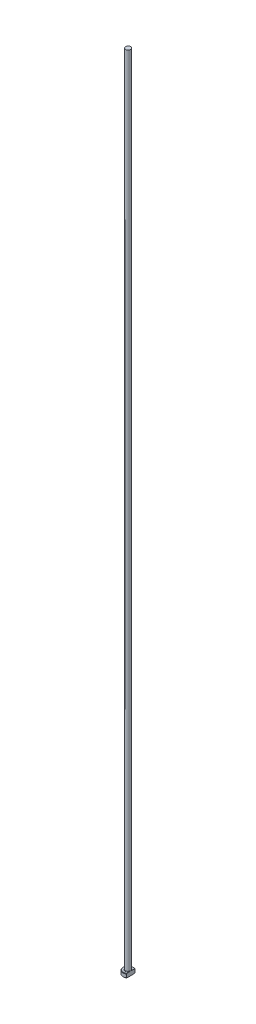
from build123d import *
from build123d.topology import SkipClean

# Parameters (mm, degrees)
CHAMFER1_SIZE = 0.2
FILLET1_R     = 0.2
KEY_DEPTH     = 401.015624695


with BuildPart() as part:
    # Sketch1 → Revolve1 (revolve)
    with BuildSketch(Plane.XY, mode=Mode.PRIVATE) as revolve1_sk:
        Polygon((0, 0), (-2.5, 0), (-2.5, 2), (-1.25, 2), (-1.25, 400), (0, 400), align=None)
    revolve(revolve1_sk.sketch.rotate(Axis((0, 259.958771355, 0), (0, -1, 0)), 270), axis=Axis((0, 259.958771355, 0), (0, -1, 0)))

    # Chamfer1
    chamfer1_edges = [part.edges().sort_by_distance(p)[0] for p in [
        (0, 2, -2.5),
        (0, 0, -2.5),
    ]]
    chamfer(chamfer1_edges, length=CHAMFER1_SIZE)

    # Fillet1
    fillet1_edges = [part.edges().sort_by_distance(p)[0] for p in [
        (0, 2, -1.25),
    ]]
    fillet(fillet1_edges, radius=FILLET1_R)

    # Sketch2 → KEY (cut, through all)
    with SkipClean():  # the faces are left unmerged after this step: merging them gives an invalid solid
        with BuildSketch(Plane(origin=(0, 0, 0), x_dir=(1, 0, 0), z_dir=(0, 1, 0))):
            with BuildLine():
                Line((1.25, 2.165063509), (1.25, -2.165063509))
                ThreePointArc((1.25, -2.165063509), (2.5, 0), (1.25, 2.165063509))
            make_face()
        extrude(amount=KEY_DEPTH, mode=Mode.SUBTRACT)


solid = part.part
